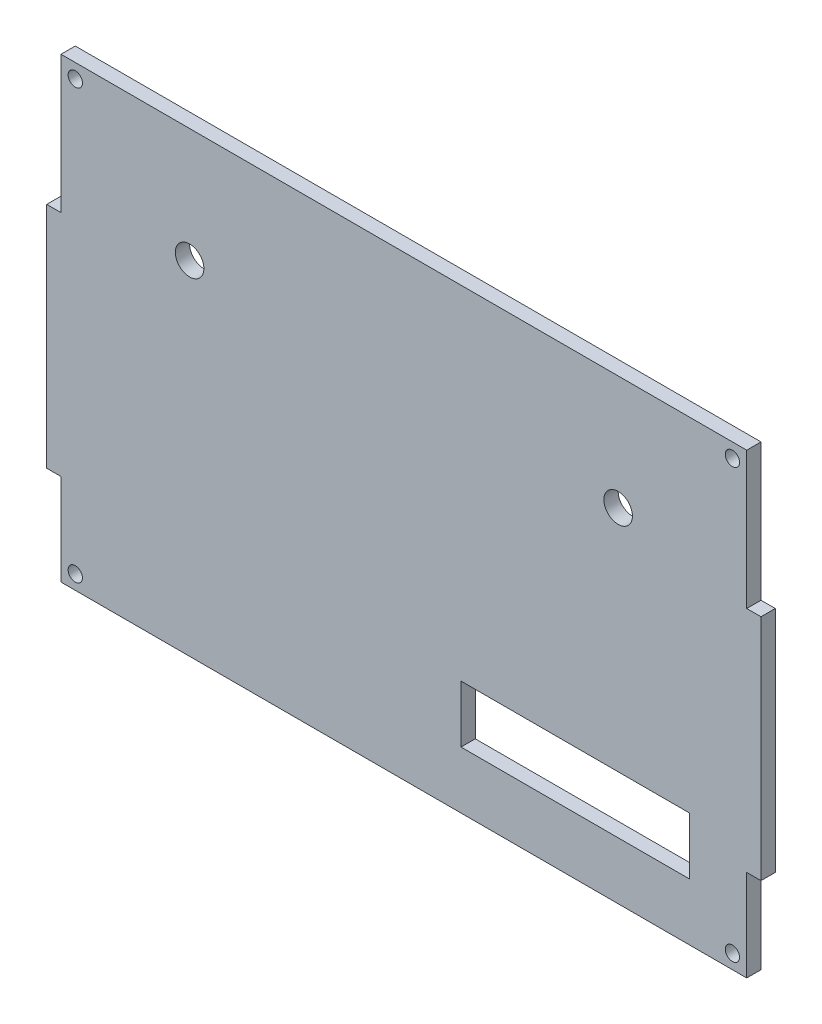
from build123d import *

# Parameters (mm, degrees)
SKETCH1_R           = 1.5875
SKETCH1_R_2         = 3.175
SKETCH1_W           = 50.8
SKETCH1_H           = 12.7
BOSS_EXTRUDE2_DEPTH = 3.175


with BuildPart() as part:
    # Sketch1 → Boss-Extrude2 (new body)
    with BuildSketch(Plane.XY):
        Polygon((-28.152069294, -62.236319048), (-28.152069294, -82.556319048), (124.247930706, -82.556319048), (124.247930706, -62.236319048), (127.422930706, -62.236319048), (127.422930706, -11.436319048), (124.247930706, -11.436319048), (124.247930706, 19.043680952), (-28.152069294, 19.043680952), (-28.152069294, -11.436319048), (-31.327069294, -11.436319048), (-31.327069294, -62.236319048), align=None)
        with Locations((-24.977069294, -79.381319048)):
            Circle(SKETCH1_R, mode=Mode.SUBTRACT)
        with Locations((-24.977069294, 15.868680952)):
            Circle(SKETCH1_R, mode=Mode.SUBTRACT)
        with Locations((121.072930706, 15.868680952)):
            Circle(SKETCH1_R, mode=Mode.SUBTRACT)
        with Locations((121.072930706, -79.381319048)):
            Circle(SKETCH1_R, mode=Mode.SUBTRACT)
        with Locations((0.422930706, -6.356319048)):
            Circle(SKETCH1_R_2, mode=Mode.SUBTRACT)
        with Locations((95.672930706, -6.356319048)):
            Circle(SKETCH1_R_2, mode=Mode.SUBTRACT)
        with Locations((86.147930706, -63.506319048)):
            Rectangle(SKETCH1_W, SKETCH1_H, mode=Mode.SUBTRACT)
    extrude(amount=BOSS_EXTRUDE2_DEPTH)


solid = part.part
